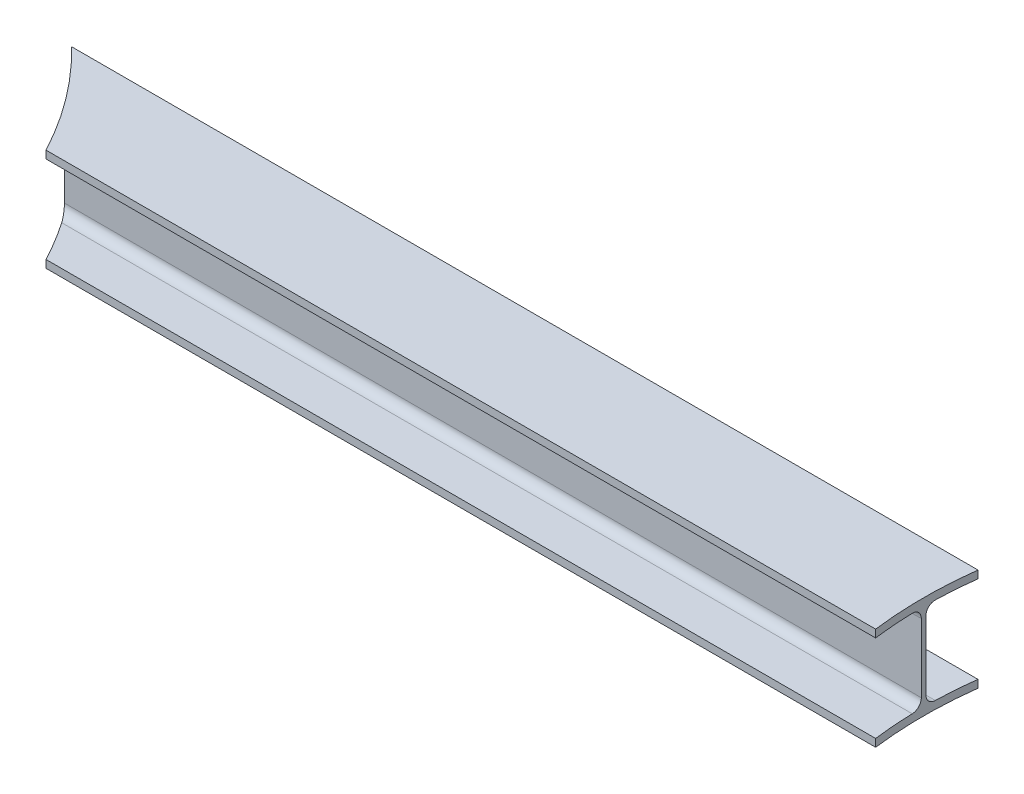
ISO-10303-21;
HEADER;
FILE_DESCRIPTION(('STEP AP214'),'2;1');
FILE_NAME('part.step','',(''),(''),'','','');
FILE_SCHEMA(('AUTOMOTIVE_DESIGN { 1 0 10303 214 1 1 1 1 }'));
ENDSEC;
DATA;
#1=APPLICATION_CONTEXT('core data for automotive mechanical design processes');
#2=APPLICATION_PROTOCOL_DEFINITION('international standard','automotive_design',2000,#1);
#3=PRODUCT_CONTEXT('',#1,'mechanical');
#4=PRODUCT('Part','Part','',(#3));
#5=PRODUCT_RELATED_PRODUCT_CATEGORY('part','',(#4));
#6=PRODUCT_DEFINITION_FORMATION('','',#4);
#7=PRODUCT_DEFINITION_CONTEXT('part definition',#1,'design');
#8=PRODUCT_DEFINITION('design','',#6,#7);
#9=PRODUCT_DEFINITION_SHAPE('','',#8);
#10=(LENGTH_UNIT() NAMED_UNIT(*) SI_UNIT(.MILLI.,.METRE.));
#11=(NAMED_UNIT(*) PLANE_ANGLE_UNIT() SI_UNIT($,.RADIAN.));
#12=(NAMED_UNIT(*) SI_UNIT($,.STERADIAN.) SOLID_ANGLE_UNIT());
#13=UNCERTAINTY_MEASURE_WITH_UNIT(LENGTH_MEASURE(1.E-05),#10,'distance_accuracy_value','');
#14=(GEOMETRIC_REPRESENTATION_CONTEXT(3) GLOBAL_UNCERTAINTY_ASSIGNED_CONTEXT((#13)) GLOBAL_UNIT_ASSIGNED_CONTEXT((#10,
#11,#12)) REPRESENTATION_CONTEXT('',''));
#15=CARTESIAN_POINT('',(0.,0.,0.));
#16=DIRECTION('',(0.,0.,1.));
#17=DIRECTION('',(1.,0.,0.));
#18=AXIS2_PLACEMENT_3D('',#15,#16,#17);
#19=CARTESIAN_POINT('',(3063.27037856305,-100.,0.));
#20=DIRECTION('',(0.,1.,0.));
#21=DIRECTION('',(0.,0.,1.));
#22=AXIS2_PLACEMENT_3D('',#19,#20,#21);
#23=CYLINDRICAL_SURFACE('',#22,800.);
#24=CARTESIAN_POINT('',(3063.27037856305,85.,0.));
#25=DIRECTION('',(0.,1.,0.));
#26=DIRECTION('',(0.,0.,1.));
#27=AXIS2_PLACEMENT_3D('',#24,#25,#26);
#28=CIRCLE('',#27,800.);
#29=CARTESIAN_POINT('',(2263.58684740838,85.,22.5));
#30=VERTEX_POINT('',#29);
#31=CARTESIAN_POINT('',(2269.54498524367,85.,100.));
#32=VERTEX_POINT('',#31);
#33=EDGE_CURVE('E326',#30,#32,#28,.T.);
#34=ORIENTED_EDGE('',*,*,#33,.F.);
#35=CARTESIAN_POINT('',(2263.28303491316,67.,4.49999999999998));
#36=CARTESIAN_POINT('',(2263.28303508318,67.2531475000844,4.49999969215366));
#37=CARTESIAN_POINT('',(2263.28306493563,67.5062668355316,4.50534094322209));
#38=CARTESIAN_POINT('',(2263.28318539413,68.0120470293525,4.52669104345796));
#39=CARTESIAN_POINT('',(2263.28327599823,68.2647079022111,4.54269954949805));
#40=CARTESIAN_POINT('',(2263.28364096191,69.0212958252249,4.60669233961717));
#41=CARTESIAN_POINT('',(2263.28400847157,69.5239572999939,4.67064391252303));
#42=CARTESIAN_POINT('',(2263.28501900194,70.5217230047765,4.84062900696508));
#43=CARTESIAN_POINT('',(2263.28566181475,71.0168326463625,4.9466307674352));
#44=CARTESIAN_POINT('',(2263.28686648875,71.7513440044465,5.13656907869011));
#45=CARTESIAN_POINT('',(2263.28730814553,71.9948320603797,5.20504122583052));
#46=CARTESIAN_POINT('',(2263.28827915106,72.4787697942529,5.35219953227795));
#47=CARTESIAN_POINT('',(2263.28880852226,72.7192186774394,5.43088830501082));
#48=CARTESIAN_POINT('',(2263.29054019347,73.4354123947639,5.68210996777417));
#49=CARTESIAN_POINT('',(2263.2918859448,73.9059366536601,5.86978070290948));
#50=CARTESIAN_POINT('',(2263.29503340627,74.8294939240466,6.28410711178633));
#51=CARTESIAN_POINT('',(2263.29683511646,75.2825269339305,6.51076278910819));
#52=CARTESIAN_POINT('',(2263.29994250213,75.9464449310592,6.87869412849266));
#53=CARTESIAN_POINT('',(2263.30104588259,76.1651642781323,7.00600834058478));
#54=CARTESIAN_POINT('',(2263.30339876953,76.5969860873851,7.26970625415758));
#55=CARTESIAN_POINT('',(2263.3046482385,76.8100899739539,7.40608762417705));
#56=CARTESIAN_POINT('',(2263.30863380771,77.4405235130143,7.82855472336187));
#57=CARTESIAN_POINT('',(2263.31160727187,77.8490192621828,8.12798795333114));
#58=CARTESIAN_POINT('',(2263.31828014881,78.6392637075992,8.76014392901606));
#59=CARTESIAN_POINT('',(2263.32197953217,79.02101348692,9.09286532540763));
#60=CARTESIAN_POINT('',(2263.33019886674,79.7551445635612,9.78928651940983));
#61=CARTESIAN_POINT('',(2263.3347188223,80.1075257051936,10.1529864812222));
#62=CARTESIAN_POINT('',(2263.3446694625,80.7804604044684,10.9088389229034));
#63=CARTESIAN_POINT('',(2263.35010032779,81.1010076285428,11.300997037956));
#64=CARTESIAN_POINT('',(2263.36195261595,81.7079169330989,12.1109075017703));
#65=CARTESIAN_POINT('',(2263.36837402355,81.9942795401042,12.5286594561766));
#66=CARTESIAN_POINT('',(2263.38227586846,82.5308184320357,13.3868339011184));
#67=CARTESIAN_POINT('',(2263.38975642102,82.780990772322,13.8272588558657));
#68=CARTESIAN_POINT('',(2263.40582783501,83.2433505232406,14.7276335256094));
#69=CARTESIAN_POINT('',(2263.41441876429,83.4555356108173,15.1875844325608));
#70=CARTESIAN_POINT('',(2263.43273699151,83.8402989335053,16.1234637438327));
#71=CARTESIAN_POINT('',(2263.44246372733,84.0128966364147,16.5993841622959));
#72=CARTESIAN_POINT('',(2263.4630647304,84.3173705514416,17.5639763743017));
#73=CARTESIAN_POINT('',(2263.47393872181,84.4492565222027,18.0526450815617));
#74=CARTESIAN_POINT('',(2263.49289844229,84.6333725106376,18.8702872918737));
#75=CARTESIAN_POINT('',(2263.50066429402,84.6974153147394,19.1966599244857));
#76=CARTESIAN_POINT('',(2263.51667373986,84.8073269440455,19.852434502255));
#77=CARTESIAN_POINT('',(2263.52491729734,84.8531971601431,20.1818362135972));
#78=CARTESIAN_POINT('',(2263.54185398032,84.9265656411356,20.8421640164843));
#79=CARTESIAN_POINT('',(2263.55054641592,84.9540912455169,21.17308709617));
#80=CARTESIAN_POINT('',(2263.56837211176,84.9908151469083,21.8360074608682));
#81=CARTESIAN_POINT('',(2263.57750546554,85.0000095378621,22.1680049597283));
#82=CARTESIAN_POINT('',(2263.58684740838,85.,22.5));
#83=B_SPLINE_CURVE_WITH_KNOTS('',3,(#35,#36,#37,#38,#39,#40,#41,#42,#43,#44,#45,#46,#47,#48,#49,
#50,#51,#52,#53,#54,#55,#56,#57,#58,#59,#60,#61,#62,#63,#64,#65,#66,#67,#68,#69,#70,#71,#72,#73,
#74,#75,#76,#77,#78,#79,#80,#81,#82),.UNSPECIFIED.,.F.,.F.,(4,2,2,2,2,2,2,2,2,2,2,2,2,2,2,2,2,2,
2,2,2,2,2,4),(0.,0.75932993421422,1.51863544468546,3.03686036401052,4.55394072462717,
5.31254293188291,6.07133957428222,7.58914178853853,9.1069441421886,9.86597922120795,
10.6248198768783,12.1423500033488,13.6598186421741,15.1772953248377,16.6950733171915,
18.212827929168,19.7307478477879,21.2487605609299,22.7660251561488,24.2829257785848,
25.2805256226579,26.2780490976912,27.2740825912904,28.2703282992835),.UNSPECIFIED.);
#84=CARTESIAN_POINT('',(2263.28303491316,67.,4.49999999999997));
#85=VERTEX_POINT('',#84);
#86=EDGE_CURVE('E320',#85,#30,#83,.T.);
#87=ORIENTED_EDGE('',*,*,#86,.F.);
#88=DIRECTION('',(0.,1.,0.));
#89=VECTOR('',#88,1.);
#90=CARTESIAN_POINT('',(2263.28303491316,-100.,4.49999999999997));
#91=LINE('',#90,#89);
#92=CARTESIAN_POINT('',(2263.28303491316,-67.,4.49999999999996));
#93=VERTEX_POINT('',#92);
#94=EDGE_CURVE('E298',#93,#85,#91,.T.);
#95=ORIENTED_EDGE('',*,*,#94,.F.);
#96=CARTESIAN_POINT('',(2263.58684740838,-85.,22.5));
#97=CARTESIAN_POINT('',(2263.57972624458,-85.0000003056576,22.2469095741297));
#98=CARTESIAN_POINT('',(2263.57272641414,-84.9946614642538,21.9938438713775));
#99=CARTESIAN_POINT('',(2263.55897890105,-84.9733201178,21.4881637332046));
#100=CARTESIAN_POINT('',(2263.55223121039,-84.9573179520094,21.2355492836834));
#101=CARTESIAN_POINT('',(2263.53238323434,-84.8933486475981,20.4790884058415));
#102=CARTESIAN_POINT('',(2263.5196744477,-84.8294186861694,19.9764965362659));
#103=CARTESIAN_POINT('',(2263.49537733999,-84.6594809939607,18.9788364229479));
#104=CARTESIAN_POINT('',(2263.48378819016,-84.5535046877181,18.4837628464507));
#105=CARTESIAN_POINT('',(2263.46726343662,-84.3636029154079,17.7492853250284));
#106=CARTESIAN_POINT('',(2263.46189814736,-84.295142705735,17.5058052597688));
#107=CARTESIAN_POINT('',(2263.45145262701,-84.1480070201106,17.0218770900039));
#108=CARTESIAN_POINT('',(2263.44637246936,-84.0693289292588,16.781429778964));
#109=CARTESIAN_POINT('',(2263.43155954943,-83.8181344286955,16.0652261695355));
#110=CARTESIAN_POINT('',(2263.42225598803,-83.6304767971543,15.5946816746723));
#111=CARTESIAN_POINT('',(2263.40478157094,-83.2161635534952,14.6710651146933));
#112=CARTESIAN_POINT('',(2263.39661071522,-82.9895079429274,14.217993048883));
#113=CARTESIAN_POINT('',(2263.38517555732,-82.6215650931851,13.554007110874));
#114=CARTESIAN_POINT('',(2263.38150041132,-82.4942454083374,13.3352640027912));
#115=CARTESIAN_POINT('',(2263.37441713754,-82.2305322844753,12.9033918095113));
#116=CARTESIAN_POINT('',(2263.3710089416,-82.0941411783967,12.6902613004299));
#117=CARTESIAN_POINT('',(2263.36117174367,-81.6716380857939,12.059744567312));
#118=CARTESIAN_POINT('',(2263.35512937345,-81.3721717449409,11.6511887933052));
#119=CARTESIAN_POINT('',(2263.34400880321,-80.7399961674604,10.8609030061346));
#120=CARTESIAN_POINT('',(2263.33893036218,-80.4072952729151,10.4791663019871));
#121=CARTESIAN_POINT('',(2263.32965026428,-79.7109065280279,9.7450484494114));
#122=CARTESIAN_POINT('',(2263.32544861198,-79.3472185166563,9.39266745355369));
#123=CARTESIAN_POINT('',(2263.31783012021,-78.5913772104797,8.71972137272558));
#124=CARTESIAN_POINT('',(2263.31441343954,-78.1992181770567,8.3991627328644));
#125=CARTESIAN_POINT('',(2263.30827108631,-77.3892911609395,7.79222285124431));
#126=CARTESIAN_POINT('',(2263.30554540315,-76.9715235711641,7.50584108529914));
#127=CARTESIAN_POINT('',(2263.30069064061,-76.113284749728,6.96924955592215));
#128=CARTESIAN_POINT('',(2263.29856164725,-75.6728102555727,6.71904501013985));
#129=CARTESIAN_POINT('',(2263.29481132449,-74.772313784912,6.25662212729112));
#130=CARTESIAN_POINT('',(2263.29319002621,-74.3122906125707,6.04440611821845));
#131=CARTESIAN_POINT('',(2263.29037500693,-73.3762435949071,5.6595876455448));
#132=CARTESIAN_POINT('',(2263.28918107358,-72.9002278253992,5.48696552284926));
#133=CARTESIAN_POINT('',(2263.28715035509,-71.935417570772,5.18245351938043));
#134=CARTESIAN_POINT('',(2263.28631348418,-71.4466261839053,5.05055386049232));
#135=CARTESIAN_POINT('',(2263.28517700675,-70.6289393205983,4.86647016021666));
#136=CARTESIAN_POINT('',(2263.28479156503,-70.3026549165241,4.80245843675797));
#137=CARTESIAN_POINT('',(2263.28413958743,-69.6470475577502,4.69259767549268));
#138=CARTESIAN_POINT('',(2263.28387304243,-69.3177248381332,4.64674724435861));
#139=CARTESIAN_POINT('',(2263.28345032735,-68.6575427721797,4.57340860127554));
#140=CARTESIAN_POINT('',(2263.28329399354,-68.3266864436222,4.54589315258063));
#141=CARTESIAN_POINT('',(2263.28308658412,-67.6638880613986,4.50918212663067));
#142=CARTESIAN_POINT('',(2263.28303553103,-67.3319457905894,4.49999047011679));
#143=CARTESIAN_POINT('',(2263.28303491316,-67.,4.49999999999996));
#144=B_SPLINE_CURVE_WITH_KNOTS('',3,(#96,#97,#98,#99,#100,#101,#102,#103,#104,#105,#106,#107,
#108,#109,#110,#111,#112,#113,#114,#115,#116,#117,#118,#119,#120,#121,#122,#123,#124,#125,#126,
#127,#128,#129,#130,#131,#132,#133,#134,#135,#136,#137,#138,#139,#140,#141,#142,#143),
.UNSPECIFIED.,.F.,.F.,(4,2,2,2,2,2,2,2,2,2,2,2,2,2,2,2,2,2,2,2,2,2,2,4),(0.,0.759459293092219,
1.51889442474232,3.03738204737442,4.55473691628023,5.31347582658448,6.07240929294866,
7.59050323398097,9.10859711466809,9.86777475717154,10.6267579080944,12.1445725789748,
13.6620072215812,15.179449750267,16.6971989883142,18.2149249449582,19.7328695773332,
21.2509071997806,22.7681894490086,24.285107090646,25.2821585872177,26.2791335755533,
27.2746242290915,28.2703278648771),.UNSPECIFIED.);
#145=CARTESIAN_POINT('',(2263.58684740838,-85.,22.5));
#146=VERTEX_POINT('',#145);
#147=EDGE_CURVE('E292',#146,#93,#144,.T.);
#148=ORIENTED_EDGE('',*,*,#147,.F.);
#149=CARTESIAN_POINT('',(3063.27037856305,-85.,0.));
#150=DIRECTION('',(0.,-1.,0.));
#151=DIRECTION('',(0.,0.,-1.));
#152=AXIS2_PLACEMENT_3D('',#149,#150,#151);
#153=CIRCLE('',#152,800.);
#154=CARTESIAN_POINT('',(2269.54498524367,-85.,100.));
#155=VERTEX_POINT('',#154);
#156=EDGE_CURVE('E289',#155,#146,#153,.T.);
#157=ORIENTED_EDGE('',*,*,#156,.F.);
#158=DIRECTION('',(0.,1.,0.));
#159=VECTOR('',#158,1.);
#160=CARTESIAN_POINT('',(2269.54498524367,-100.,100.));
#161=LINE('',#160,#159);
#162=CARTESIAN_POINT('',(2269.54498524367,-100.,100.));
#163=VERTEX_POINT('',#162);
#164=EDGE_CURVE('E286',#163,#155,#161,.T.);
#165=ORIENTED_EDGE('',*,*,#164,.F.);
#166=CARTESIAN_POINT('',(3063.27037856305,-100.,0.));
#167=DIRECTION('',(0.,1.,0.));
#168=DIRECTION('',(0.,0.,1.));
#169=AXIS2_PLACEMENT_3D('',#166,#167,#168);
#170=CIRCLE('',#169,800.);
#171=CARTESIAN_POINT('',(2269.54498524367,-100.,-100.));
#172=VERTEX_POINT('',#171);
#173=EDGE_CURVE('E223',#172,#163,#170,.T.);
#174=ORIENTED_EDGE('',*,*,#173,.F.);
#175=DIRECTION('',(0.,1.,0.));
#176=VECTOR('',#175,1.);
#177=CARTESIAN_POINT('',(2269.54498524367,-99.9999999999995,-100.));
#178=LINE('',#177,#176);
#179=CARTESIAN_POINT('',(2269.54498524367,-85.,-99.9999999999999));
#180=VERTEX_POINT('',#179);
#181=EDGE_CURVE('E60',#180,#172,#178,.F.);
#182=ORIENTED_EDGE('',*,*,#181,.F.);
#183=CARTESIAN_POINT('',(3063.27037856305,-85.,0.));
#184=DIRECTION('',(0.,-1.,0.));
#185=DIRECTION('',(0.,0.,-1.));
#186=AXIS2_PLACEMENT_3D('',#183,#184,#185);
#187=CIRCLE('',#186,800.);
#188=CARTESIAN_POINT('',(2263.58684740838,-85.,-22.5));
#189=VERTEX_POINT('',#188);
#190=EDGE_CURVE('E46',#189,#180,#187,.T.);
#191=ORIENTED_EDGE('',*,*,#190,.F.);
#192=CARTESIAN_POINT('',(2263.28303491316,-67.,-4.49999999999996));
#193=CARTESIAN_POINT('',(2263.28303508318,-67.2531475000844,-4.49999969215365));
#194=CARTESIAN_POINT('',(2263.28306493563,-67.5062668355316,-4.50534094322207));
#195=CARTESIAN_POINT('',(2263.28318539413,-68.0120470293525,-4.52669104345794));
#196=CARTESIAN_POINT('',(2263.28327599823,-68.2647079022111,-4.54269954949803));
#197=CARTESIAN_POINT('',(2263.28364096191,-69.0212958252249,-4.60669233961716));
#198=CARTESIAN_POINT('',(2263.28400847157,-69.5239572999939,-4.67064391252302));
#199=CARTESIAN_POINT('',(2263.28501900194,-70.5217230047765,-4.84062900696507));
#200=CARTESIAN_POINT('',(2263.28566181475,-71.0168326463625,-4.94663076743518));
#201=CARTESIAN_POINT('',(2263.28686648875,-71.7513440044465,-5.1365690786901));
#202=CARTESIAN_POINT('',(2263.28730814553,-71.9948320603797,-5.2050412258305));
#203=CARTESIAN_POINT('',(2263.28827915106,-72.4787697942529,-5.35219953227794));
#204=CARTESIAN_POINT('',(2263.28880852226,-72.7192186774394,-5.4308883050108));
#205=CARTESIAN_POINT('',(2263.29054019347,-73.4354123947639,-5.68210996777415));
#206=CARTESIAN_POINT('',(2263.2918859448,-73.9059366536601,-5.86978070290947));
#207=CARTESIAN_POINT('',(2263.29503340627,-74.8294939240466,-6.28410711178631));
#208=CARTESIAN_POINT('',(2263.29683511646,-75.2825269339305,-6.51076278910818));
#209=CARTESIAN_POINT('',(2263.29994250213,-75.9464449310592,-6.87869412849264));
#210=CARTESIAN_POINT('',(2263.30104588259,-76.1651642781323,-7.00600834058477));
#211=CARTESIAN_POINT('',(2263.30339876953,-76.5969860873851,-7.26970625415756));
#212=CARTESIAN_POINT('',(2263.3046482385,-76.8100899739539,-7.40608762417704));
#213=CARTESIAN_POINT('',(2263.30863380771,-77.4405235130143,-7.82855472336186));
#214=CARTESIAN_POINT('',(2263.31160727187,-77.8490192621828,-8.12798795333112));
#215=CARTESIAN_POINT('',(2263.31828014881,-78.6392637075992,-8.76014392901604));
#216=CARTESIAN_POINT('',(2263.32197953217,-79.02101348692,-9.09286532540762));
#217=CARTESIAN_POINT('',(2263.33019886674,-79.7551445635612,-9.78928651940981));
#218=CARTESIAN_POINT('',(2263.3347188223,-80.1075257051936,-10.1529864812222));
#219=CARTESIAN_POINT('',(2263.3446694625,-80.7804604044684,-10.9088389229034));
#220=CARTESIAN_POINT('',(2263.35010032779,-81.1010076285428,-11.300997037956));
#221=CARTESIAN_POINT('',(2263.36195261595,-81.7079169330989,-12.1109075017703));
#222=CARTESIAN_POINT('',(2263.36837402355,-81.9942795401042,-12.5286594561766));
#223=CARTESIAN_POINT('',(2263.38227586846,-82.5308184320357,-13.3868339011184));
#224=CARTESIAN_POINT('',(2263.38975642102,-82.780990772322,-13.8272588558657));
#225=CARTESIAN_POINT('',(2263.40582783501,-83.2433505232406,-14.7276335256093));
#226=CARTESIAN_POINT('',(2263.41441876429,-83.4555356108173,-15.1875844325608));
#227=CARTESIAN_POINT('',(2263.43273699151,-83.8402989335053,-16.1234637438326));
#228=CARTESIAN_POINT('',(2263.44246372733,-84.0128966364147,-16.5993841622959));
#229=CARTESIAN_POINT('',(2263.4630647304,-84.3173705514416,-17.5639763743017));
#230=CARTESIAN_POINT('',(2263.47393872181,-84.4492565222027,-18.0526450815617));
#231=CARTESIAN_POINT('',(2263.49289844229,-84.6333725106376,-18.8702872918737));
#232=CARTESIAN_POINT('',(2263.50066429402,-84.6974153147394,-19.1966599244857));
#233=CARTESIAN_POINT('',(2263.51667373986,-84.8073269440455,-19.852434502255));
#234=CARTESIAN_POINT('',(2263.52491729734,-84.8531971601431,-20.1818362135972));
#235=CARTESIAN_POINT('',(2263.54185398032,-84.9265656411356,-20.8421640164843));
#236=CARTESIAN_POINT('',(2263.55054641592,-84.9540912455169,-21.17308709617));
#237=CARTESIAN_POINT('',(2263.56837211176,-84.9908151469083,-21.8360074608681));
#238=CARTESIAN_POINT('',(2263.57750546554,-85.0000095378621,-22.1680049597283));
#239=CARTESIAN_POINT('',(2263.58684740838,-85.,-22.5));
#240=B_SPLINE_CURVE_WITH_KNOTS('',3,(#192,#193,#194,#195,#196,#197,#198,#199,#200,#201,#202,
#203,#204,#205,#206,#207,#208,#209,#210,#211,#212,#213,#214,#215,#216,#217,#218,#219,#220,#221,
#222,#223,#224,#225,#226,#227,#228,#229,#230,#231,#232,#233,#234,#235,#236,#237,#238,#239),
.UNSPECIFIED.,.F.,.F.,(4,2,2,2,2,2,2,2,2,2,2,2,2,2,2,2,2,2,2,2,2,2,2,4),(0.,0.75932993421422,
1.51863544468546,3.03686036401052,4.55394072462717,5.31254293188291,6.07133957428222,
7.58914178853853,9.1069441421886,9.86597922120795,10.6248198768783,12.1423500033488,
13.6598186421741,15.1772953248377,16.6950733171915,18.212827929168,19.7307478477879,
21.2487605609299,22.7660251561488,24.2829257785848,25.2805256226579,26.2780490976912,
27.2740825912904,28.2703282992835),.UNSPECIFIED.);
#241=CARTESIAN_POINT('',(2263.28303491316,-67.,-4.49999999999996));
#242=VERTEX_POINT('',#241);
#243=EDGE_CURVE('E220',#242,#189,#240,.T.);
#244=ORIENTED_EDGE('',*,*,#243,.F.);
#245=DIRECTION('',(0.,1.,0.));
#246=VECTOR('',#245,1.);
#247=CARTESIAN_POINT('',(2263.28303491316,-100.,-4.49999999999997));
#248=LINE('',#247,#246);
#249=CARTESIAN_POINT('',(2263.28303491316,67.,-4.49999999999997));
#250=VERTEX_POINT('',#249);
#251=EDGE_CURVE('E217',#250,#242,#248,.F.);
#252=ORIENTED_EDGE('',*,*,#251,.F.);
#253=CARTESIAN_POINT('',(2263.58684740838,85.,-22.5));
#254=CARTESIAN_POINT('',(2263.57972624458,85.0000003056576,-22.2469095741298));
#255=CARTESIAN_POINT('',(2263.57272641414,84.9946614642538,-21.9938438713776));
#256=CARTESIAN_POINT('',(2263.55897890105,84.9733201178,-21.4881637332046));
#257=CARTESIAN_POINT('',(2263.55223121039,84.9573179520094,-21.2355492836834));
#258=CARTESIAN_POINT('',(2263.53238323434,84.8933486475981,-20.4790884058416));
#259=CARTESIAN_POINT('',(2263.5196744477,84.8294186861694,-19.976496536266));
#260=CARTESIAN_POINT('',(2263.49537733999,84.6594809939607,-18.9788364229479));
#261=CARTESIAN_POINT('',(2263.48378819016,84.5535046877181,-18.4837628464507));
#262=CARTESIAN_POINT('',(2263.46726343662,84.3636029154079,-17.7492853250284));
#263=CARTESIAN_POINT('',(2263.46189814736,84.295142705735,-17.5058052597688));
#264=CARTESIAN_POINT('',(2263.45145262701,84.1480070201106,-17.0218770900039));
#265=CARTESIAN_POINT('',(2263.44637246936,84.0693289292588,-16.781429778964));
#266=CARTESIAN_POINT('',(2263.43155954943,83.8181344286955,-16.0652261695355));
#267=CARTESIAN_POINT('',(2263.42225598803,83.6304767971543,-15.5946816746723));
#268=CARTESIAN_POINT('',(2263.40478157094,83.2161635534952,-14.6710651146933));
#269=CARTESIAN_POINT('',(2263.39661071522,82.9895079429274,-14.217993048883));
#270=CARTESIAN_POINT('',(2263.38517555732,82.6215650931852,-13.554007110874));
#271=CARTESIAN_POINT('',(2263.38150041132,82.4942454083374,-13.3352640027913));
#272=CARTESIAN_POINT('',(2263.37441713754,82.2305322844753,-12.9033918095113));
#273=CARTESIAN_POINT('',(2263.3710089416,82.0941411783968,-12.69026130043));
#274=CARTESIAN_POINT('',(2263.36117174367,81.6716380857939,-12.059744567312));
#275=CARTESIAN_POINT('',(2263.35512937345,81.3721717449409,-11.6511887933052));
#276=CARTESIAN_POINT('',(2263.34400880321,80.7399961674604,-10.8609030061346));
#277=CARTESIAN_POINT('',(2263.33893036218,80.4072952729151,-10.4791663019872));
#278=CARTESIAN_POINT('',(2263.32965026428,79.7109065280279,-9.74504844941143));
#279=CARTESIAN_POINT('',(2263.32544861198,79.3472185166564,-9.39266745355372));
#280=CARTESIAN_POINT('',(2263.31783012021,78.5913772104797,-8.71972137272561));
#281=CARTESIAN_POINT('',(2263.31441343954,78.1992181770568,-8.39916273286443));
#282=CARTESIAN_POINT('',(2263.30827108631,77.3892911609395,-7.79222285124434));
#283=CARTESIAN_POINT('',(2263.30554540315,76.9715235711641,-7.50584108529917));
#284=CARTESIAN_POINT('',(2263.30069064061,76.113284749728,-6.96924955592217));
#285=CARTESIAN_POINT('',(2263.29856164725,75.6728102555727,-6.71904501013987));
#286=CARTESIAN_POINT('',(2263.29481132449,74.772313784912,-6.25662212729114));
#287=CARTESIAN_POINT('',(2263.29319002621,74.3122906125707,-6.04440611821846));
#288=CARTESIAN_POINT('',(2263.29037500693,73.3762435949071,-5.65958764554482));
#289=CARTESIAN_POINT('',(2263.28918107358,72.9002278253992,-5.48696552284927));
#290=CARTESIAN_POINT('',(2263.28715035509,71.935417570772,-5.18245351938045));
#291=CARTESIAN_POINT('',(2263.28631348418,71.4466261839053,-5.05055386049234));
#292=CARTESIAN_POINT('',(2263.28517700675,70.6289393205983,-4.86647016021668));
#293=CARTESIAN_POINT('',(2263.28479156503,70.3026549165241,-4.80245843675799));
#294=CARTESIAN_POINT('',(2263.28413958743,69.6470475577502,-4.6925976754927));
#295=CARTESIAN_POINT('',(2263.28387304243,69.3177248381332,-4.64674724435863));
#296=CARTESIAN_POINT('',(2263.28345032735,68.6575427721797,-4.57340860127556));
#297=CARTESIAN_POINT('',(2263.28329399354,68.3266864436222,-4.54589315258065));
#298=CARTESIAN_POINT('',(2263.28308658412,67.6638880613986,-4.50918212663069));
#299=CARTESIAN_POINT('',(2263.28303553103,67.3319457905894,-4.49999047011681));
#300=CARTESIAN_POINT('',(2263.28303491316,67.,-4.49999999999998));
#301=B_SPLINE_CURVE_WITH_KNOTS('',3,(#253,#254,#255,#256,#257,#258,#259,#260,#261,#262,#263,
#264,#265,#266,#267,#268,#269,#270,#271,#272,#273,#274,#275,#276,#277,#278,#279,#280,#281,#282,
#283,#284,#285,#286,#287,#288,#289,#290,#291,#292,#293,#294,#295,#296,#297,#298,#299,#300),
.UNSPECIFIED.,.F.,.F.,(4,2,2,2,2,2,2,2,2,2,2,2,2,2,2,2,2,2,2,2,2,2,2,4),(0.,0.759459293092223,
1.51889442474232,3.03738204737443,4.55473691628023,5.31347582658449,6.07240929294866,
7.59050323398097,9.10859711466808,9.86777475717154,10.6267579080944,12.1445725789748,
13.6620072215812,15.179449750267,16.6971989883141,18.2149249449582,19.7328695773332,
21.2509071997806,22.7681894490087,24.285107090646,25.2821585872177,26.2791335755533,
27.2746242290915,28.2703278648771),.UNSPECIFIED.);
#302=CARTESIAN_POINT('',(2263.58684740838,85.,-22.5));
#303=VERTEX_POINT('',#302);
#304=EDGE_CURVE('E272',#303,#250,#301,.T.);
#305=ORIENTED_EDGE('',*,*,#304,.F.);
#306=CARTESIAN_POINT('',(3063.27037856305,85.,0.));
#307=DIRECTION('',(0.,1.,0.));
#308=DIRECTION('',(0.,0.,1.));
#309=AXIS2_PLACEMENT_3D('',#306,#307,#308);
#310=CIRCLE('',#309,800.);
#311=CARTESIAN_POINT('',(2269.54498524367,85.,-100.));
#312=VERTEX_POINT('',#311);
#313=EDGE_CURVE('E279',#312,#303,#310,.T.);
#314=ORIENTED_EDGE('',*,*,#313,.F.);
#315=DIRECTION('',(0.,1.,0.));
#316=VECTOR('',#315,1.);
#317=CARTESIAN_POINT('',(2269.54498524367,-100.,-100.));
#318=LINE('',#317,#316);
#319=CARTESIAN_POINT('',(2269.54498524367,100.,-100.));
#320=VERTEX_POINT('',#319);
#321=EDGE_CURVE('E283',#320,#312,#318,.F.);
#322=ORIENTED_EDGE('',*,*,#321,.F.);
#323=CARTESIAN_POINT('',(3063.27037856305,100.,0.));
#324=DIRECTION('',(0.,1.,0.));
#325=DIRECTION('',(0.,0.,1.));
#326=AXIS2_PLACEMENT_3D('',#323,#324,#325);
#327=CIRCLE('',#326,800.);
#328=CARTESIAN_POINT('',(2269.54498524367,100.,100.));
#329=VERTEX_POINT('',#328);
#330=EDGE_CURVE('E221',#320,#329,#327,.T.);
#331=ORIENTED_EDGE('',*,*,#330,.T.);
#332=DIRECTION('',(0.,1.,0.));
#333=VECTOR('',#332,1.);
#334=CARTESIAN_POINT('',(2269.54498524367,-100.,100.));
#335=LINE('',#334,#333);
#336=EDGE_CURVE('E169',#32,#329,#335,.T.);
#337=ORIENTED_EDGE('',*,*,#336,.F.);
#338=EDGE_LOOP('',(#34,#87,#95,#148,#157,#165,#174,#182,#191,#244,#252,#305,#314,#322,#331,#337));
#339=FACE_BOUND('',#338,.T.);
#340=ADVANCED_FACE('F37',(#339),#23,.F.);
#341=CARTESIAN_POINT('',(2363.27037856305,-85.,-99.9999999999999));
#342=DIRECTION('',(0.,-1.,0.));
#343=DIRECTION('',(0.,0.,-1.));
#344=AXIS2_PLACEMENT_3D('',#341,#342,#343);
#345=PLANE('',#344);
#346=CARTESIAN_POINT('',(-58.4029469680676,-84.9999999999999,474.207088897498));
#347=DIRECTION('',(0.,-1.,0.));
#348=DIRECTION('',(0.,0.,-1.));
#349=AXIS2_PLACEMENT_3D('',#346,#347,#348);
#350=CIRCLE('',#349,800.);
#351=CARTESIAN_POINT('',(568.719104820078,-85.,-22.5));
#352=VERTEX_POINT('',#351);
#353=CARTESIAN_POINT('',(498.630462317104,-85.0000000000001,-99.9999999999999));
#354=VERTEX_POINT('',#353);
#355=EDGE_CURVE('E11',#352,#354,#350,.F.);
#356=ORIENTED_EDGE('',*,*,#355,.F.);
#357=DIRECTION('',(-1.,0.,0.));
#358=VECTOR('',#357,1.);
#359=CARTESIAN_POINT('',(2363.27037856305,-85.,-22.5));
#360=LINE('',#359,#358);
#361=EDGE_CURVE('E165',#189,#352,#360,.T.);
#362=ORIENTED_EDGE('',*,*,#361,.F.);
#363=ORIENTED_EDGE('',*,*,#190,.T.);
#364=DIRECTION('',(-1.,0.,0.));
#365=VECTOR('',#364,1.);
#366=CARTESIAN_POINT('',(2363.27037856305,-85.,-99.9999999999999));
#367=LINE('',#366,#365);
#368=EDGE_CURVE('E159',#180,#354,#367,.T.);
#369=ORIENTED_EDGE('',*,*,#368,.T.);
#370=EDGE_LOOP('',(#356,#362,#363,#369));
#371=FACE_BOUND('',#370,.T.);
#372=ADVANCED_FACE('F164',(#371),#345,.F.);
#373=CARTESIAN_POINT('',(2363.27037856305,-100.,-100.));
#374=DIRECTION('',(0.,0.,1.));
#375=DIRECTION('',(0.,-1.,0.));
#376=AXIS2_PLACEMENT_3D('',#373,#374,#375);
#377=PLANE('',#376);
#378=DIRECTION('',(0.,-1.,0.));
#379=VECTOR('',#378,1.);
#380=CARTESIAN_POINT('',(498.630462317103,-337.72683831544,-100.000000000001));
#381=LINE('',#380,#379);
#382=CARTESIAN_POINT('',(498.630462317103,-99.9999999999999,-100.000000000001));
#383=VERTEX_POINT('',#382);
#384=EDGE_CURVE('E149',#354,#383,#381,.T.);
#385=ORIENTED_EDGE('',*,*,#384,.F.);
#386=ORIENTED_EDGE('',*,*,#368,.F.);
#387=ORIENTED_EDGE('',*,*,#181,.T.);
#388=DIRECTION('',(-1.,0.,0.));
#389=VECTOR('',#388,1.);
#390=CARTESIAN_POINT('',(2363.27037856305,-100.,-100.));
#391=LINE('',#390,#389);
#392=EDGE_CURVE('E161',#172,#383,#391,.T.);
#393=ORIENTED_EDGE('',*,*,#392,.T.);
#394=EDGE_LOOP('',(#385,#386,#387,#393));
#395=FACE_BOUND('',#394,.T.);
#396=ADVANCED_FACE('F158',(#395),#377,.F.);
#397=CARTESIAN_POINT('',(2363.27037856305,-100.,100.));
#398=DIRECTION('',(0.,1.,0.));
#399=DIRECTION('',(0.,0.,1.));
#400=AXIS2_PLACEMENT_3D('',#397,#398,#399);
#401=PLANE('',#400);
#402=CARTESIAN_POINT('',(-58.4029469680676,-100.,474.207088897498));
#403=DIRECTION('',(0.,1.,0.));
#404=DIRECTION('',(0.,0.,1.));
#405=AXIS2_PLACEMENT_3D('',#402,#403,#404);
#406=CIRCLE('',#405,800.);
#407=CARTESIAN_POINT('',(648.681952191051,-100.,100.));
#408=VERTEX_POINT('',#407);
#409=EDGE_CURVE('E162',#383,#408,#406,.F.);
#410=ORIENTED_EDGE('',*,*,#409,.F.);
#411=ORIENTED_EDGE('',*,*,#392,.F.);
#412=ORIENTED_EDGE('',*,*,#173,.T.);
#413=DIRECTION('',(-1.,0.,0.));
#414=VECTOR('',#413,1.);
#415=CARTESIAN_POINT('',(2363.27037856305,-100.,100.));
#416=LINE('',#415,#414);
#417=EDGE_CURVE('E167',#163,#408,#416,.T.);
#418=ORIENTED_EDGE('',*,*,#417,.T.);
#419=EDGE_LOOP('',(#410,#411,#412,#418));
#420=FACE_BOUND('',#419,.T.);
#421=ADVANCED_FACE('F363',(#420),#401,.F.);
#422=CARTESIAN_POINT('',(2363.27037856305,-85.,100.));
#423=DIRECTION('',(0.,0.,-1.));
#424=DIRECTION('',(-1.,0.,0.));
#425=AXIS2_PLACEMENT_3D('',#422,#423,#424);
#426=PLANE('',#425);
#427=DIRECTION('',(0.,-1.,0.));
#428=VECTOR('',#427,1.);
#429=CARTESIAN_POINT('',(648.681952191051,-337.726838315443,100.));
#430=LINE('',#429,#428);
#431=CARTESIAN_POINT('',(648.681952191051,-85.,100.));
#432=VERTEX_POINT('',#431);
#433=EDGE_CURVE('E352',#408,#432,#430,.F.);
#434=ORIENTED_EDGE('',*,*,#433,.F.);
#435=ORIENTED_EDGE('',*,*,#417,.F.);
#436=ORIENTED_EDGE('',*,*,#164,.T.);
#437=DIRECTION('',(-1.,0.,0.));
#438=VECTOR('',#437,1.);
#439=CARTESIAN_POINT('',(2363.27037856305,-85.,100.));
#440=LINE('',#439,#438);
#441=EDGE_CURVE('E175',#155,#432,#440,.T.);
#442=ORIENTED_EDGE('',*,*,#441,.T.);
#443=EDGE_LOOP('',(#434,#435,#436,#442));
#444=FACE_BOUND('',#443,.T.);
#445=ADVANCED_FACE('F360',(#444),#426,.F.);
#446=CARTESIAN_POINT('',(2363.27037856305,-85.,22.5));
#447=DIRECTION('',(0.,-1.,0.));
#448=DIRECTION('',(0.,0.,-1.));
#449=AXIS2_PLACEMENT_3D('',#446,#447,#448);
#450=PLANE('',#449);
#451=CARTESIAN_POINT('',(-58.4029469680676,-85.0000000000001,474.207088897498));
#452=DIRECTION('',(0.,-1.,0.));
#453=DIRECTION('',(0.,0.,-1.));
#454=AXIS2_PLACEMENT_3D('',#451,#452,#453);
#455=CIRCLE('',#454,800.);
#456=CARTESIAN_POINT('',(601.870258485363,-85.,22.5));
#457=VERTEX_POINT('',#456);
#458=EDGE_CURVE('E350',#432,#457,#455,.F.);
#459=ORIENTED_EDGE('',*,*,#458,.F.);
#460=ORIENTED_EDGE('',*,*,#441,.F.);
#461=ORIENTED_EDGE('',*,*,#156,.T.);
#462=DIRECTION('',(-1.,0.,0.));
#463=VECTOR('',#462,1.);
#464=CARTESIAN_POINT('',(2363.27037856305,-85.,22.5));
#465=LINE('',#464,#463);
#466=EDGE_CURVE('E178',#146,#457,#465,.T.);
#467=ORIENTED_EDGE('',*,*,#466,.T.);
#468=EDGE_LOOP('',(#459,#460,#461,#467));
#469=FACE_BOUND('',#468,.T.);
#470=ADVANCED_FACE('F306',(#469),#450,.F.);
#471=CARTESIAN_POINT('',(2363.27037856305,-67.,22.5));
#472=DIRECTION('',(-1.,0.,0.));
#473=DIRECTION('',(0.,0.,1.));
#474=AXIS2_PLACEMENT_3D('',#471,#472,#473);
#475=CYLINDRICAL_SURFACE('',#474,18.);
#476=CARTESIAN_POINT('',(601.870258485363,-85.,22.5));
#477=CARTESIAN_POINT('',(601.440103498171,-84.9999618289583,21.871209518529));
#478=CARTESIAN_POINT('',(601.009018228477,-84.9670496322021,21.243027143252));
#479=CARTESIAN_POINT('',(600.148097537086,-84.8355631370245,19.9922790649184));
#480=CARTESIAN_POINT('',(599.718262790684,-84.7369582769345,19.3697161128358));
#481=CARTESIAN_POINT('',(598.859430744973,-84.4729647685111,18.1295271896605));
#482=CARTESIAN_POINT('',(598.430477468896,-84.3069705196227,17.5119992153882));
#483=CARTESIAN_POINT('',(597.581173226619,-83.9080873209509,16.2929207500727));
#484=CARTESIAN_POINT('',(597.160820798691,-83.6752098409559,15.6913675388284));
#485=CARTESIAN_POINT('',(596.350826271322,-83.1539732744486,14.5354967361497));
#486=CARTESIAN_POINT('',(595.960645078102,-82.868486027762,13.9802639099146));
#487=CARTESIAN_POINT('',(595.195718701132,-82.2358375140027,12.8945862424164));
#488=CARTESIAN_POINT('',(594.820975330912,-81.8886690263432,12.3641443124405));
#489=CARTESIAN_POINT('',(594.093065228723,-81.134248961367,11.336319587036));
#490=CARTESIAN_POINT('',(593.739815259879,-80.7272532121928,10.8388085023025));
#491=CARTESIAN_POINT('',(593.058477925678,-79.8526476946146,9.88138778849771));
#492=CARTESIAN_POINT('',(592.730377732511,-79.3850691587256,9.42145898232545));
#493=CARTESIAN_POINT('',(592.206324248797,-78.5515686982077,8.68833646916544));
#494=CARTESIAN_POINT('',(592.001944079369,-78.2016594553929,8.40284748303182));
#495=CARTESIAN_POINT('',(591.609381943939,-77.4755193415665,7.85519852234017));
#496=CARTESIAN_POINT('',(591.421196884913,-77.0992935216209,7.59303409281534));
#497=CARTESIAN_POINT('',(591.063058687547,-76.3214524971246,7.09468087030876));
#498=CARTESIAN_POINT('',(590.893111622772,-75.919828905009,6.85850072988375));
#499=CARTESIAN_POINT('',(590.653651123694,-75.2998826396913,6.52605320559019));
#500=CARTESIAN_POINT('',(590.576405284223,-75.0903080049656,6.41887121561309));
#501=CARTESIAN_POINT('',(590.427300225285,-74.6654783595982,6.21208190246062));
#502=CARTESIAN_POINT('',(590.355442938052,-74.4502213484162,6.11247729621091));
#503=CARTESIAN_POINT('',(590.147256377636,-73.7928059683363,5.8240294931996));
#504=CARTESIAN_POINT('',(590.019634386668,-73.3424083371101,5.64738688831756));
#505=CARTESIAN_POINT('',(589.789782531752,-72.4230304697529,5.32946731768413));
#506=CARTESIAN_POINT('',(589.687548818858,-71.9540530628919,5.18818499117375));
#507=CARTESIAN_POINT('',(589.554786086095,-71.240109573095,5.00480652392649));
#508=CARTESIAN_POINT('',(589.513990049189,-71.0005977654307,4.94847496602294));
#509=CARTESIAN_POINT('',(589.439401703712,-70.5184604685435,4.84550618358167));
#510=CARTESIAN_POINT('',(589.405607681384,-70.2758357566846,4.79886658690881));
#511=CARTESIAN_POINT('',(589.345213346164,-69.7881548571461,4.71553044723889));
#512=CARTESIAN_POINT('',(589.318608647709,-69.5431002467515,4.67882784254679));
#513=CARTESIAN_POINT('',(589.272708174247,-69.0510234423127,4.61551395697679));
#514=CARTESIAN_POINT('',(589.253411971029,-68.8040013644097,4.58890208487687));
#515=CARTESIAN_POINT('',(589.221552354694,-68.2977357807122,4.54496705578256));
#516=CARTESIAN_POINT('',(589.209321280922,-68.0384313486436,4.52810238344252));
#517=CARTESIAN_POINT('',(589.193015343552,-67.5194178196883,4.50562027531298));
#518=CARTESIAN_POINT('',(589.18892991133,-67.2597096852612,4.49998826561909));
#519=CARTESIAN_POINT('',(589.188938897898,-67.,4.49999999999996));
#520=B_SPLINE_CURVE_WITH_KNOTS('',3,(#476,#477,#478,#479,#480,#481,#482,#483,#484,#485,#486,
#487,#488,#489,#490,#491,#492,#493,#494,#495,#496,#497,#498,#499,#500,#501,#502,#503,#504,#505,
#506,#507,#508,#509,#510,#511,#512,#513,#514,#515,#516,#517,#518,#519),.UNSPECIFIED.,.F.,.F.,(4,
2,2,2,2,2,2,2,2,2,2,2,2,2,2,2,2,2,2,2,2,4),(0.,2.28487440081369,4.57081251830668,
6.87776492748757,9.18432195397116,11.3900042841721,13.5959449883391,15.7927133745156,
17.9883537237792,19.4740822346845,20.9595263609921,22.4454636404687,23.1884826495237,
23.9317668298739,25.430553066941,26.9291119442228,27.6770747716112,28.4248543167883,
29.1721766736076,29.9194552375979,30.6995022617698,31.4785365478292),.UNSPECIFIED.);
#521=CARTESIAN_POINT('',(589.188938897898,-67.,4.49999999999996));
#522=VERTEX_POINT('',#521);
#523=EDGE_CURVE('E241',#457,#522,#520,.T.);
#524=ORIENTED_EDGE('',*,*,#523,.F.);
#525=ORIENTED_EDGE('',*,*,#466,.F.);
#526=ORIENTED_EDGE('',*,*,#147,.T.);
#527=DIRECTION('',(-1.,0.,0.));
#528=VECTOR('',#527,1.);
#529=CARTESIAN_POINT('',(2363.27037856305,-67.,4.49999999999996));
#530=LINE('',#529,#528);
#531=EDGE_CURVE('E181',#93,#522,#530,.T.);
#532=ORIENTED_EDGE('',*,*,#531,.T.);
#533=EDGE_LOOP('',(#524,#525,#526,#532));
#534=FACE_BOUND('',#533,.T.);
#535=ADVANCED_FACE('F300',(#534),#475,.F.);
#536=CARTESIAN_POINT('',(2363.27037856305,67.,4.49999999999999));
#537=DIRECTION('',(0.,0.,-1.));
#538=DIRECTION('',(0.,1.,0.));
#539=AXIS2_PLACEMENT_3D('',#536,#537,#538);
#540=PLANE('',#539);
#541=DIRECTION('',(0.,-1.,0.));
#542=VECTOR('',#541,1.);
#543=CARTESIAN_POINT('',(589.188938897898,-337.726838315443,4.49999999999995));
#544=LINE('',#543,#542);
#545=CARTESIAN_POINT('',(589.188938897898,67.0000000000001,4.49999999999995));
#546=VERTEX_POINT('',#545);
#547=EDGE_CURVE('E347',#522,#546,#544,.F.);
#548=ORIENTED_EDGE('',*,*,#547,.F.);
#549=ORIENTED_EDGE('',*,*,#531,.F.);
#550=ORIENTED_EDGE('',*,*,#94,.T.);
#551=DIRECTION('',(-1.,0.,0.));
#552=VECTOR('',#551,1.);
#553=CARTESIAN_POINT('',(2363.27037856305,67.,4.49999999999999));
#554=LINE('',#553,#552);
#555=EDGE_CURVE('E184',#85,#546,#554,.T.);
#556=ORIENTED_EDGE('',*,*,#555,.T.);
#557=EDGE_LOOP('',(#548,#549,#550,#556));
#558=FACE_BOUND('',#557,.T.);
#559=ADVANCED_FACE('F305',(#558),#540,.F.);
#560=CARTESIAN_POINT('',(2363.27037856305,67.,22.5));
#561=DIRECTION('',(-1.,0.,0.));
#562=DIRECTION('',(0.,0.,1.));
#563=AXIS2_PLACEMENT_3D('',#560,#561,#562);
#564=CYLINDRICAL_SURFACE('',#563,18.);
#565=CARTESIAN_POINT('',(589.188938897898,67.,4.49999999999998));
#566=CARTESIAN_POINT('',(589.188937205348,67.2194570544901,4.49999791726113));
#567=CARTESIAN_POINT('',(589.191850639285,67.4388833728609,4.50401442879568));
#568=CARTESIAN_POINT('',(589.203483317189,67.8772787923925,4.52005310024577));
#569=CARTESIAN_POINT('',(589.212202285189,68.0962479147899,4.53207487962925));
#570=CARTESIAN_POINT('',(589.24701462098,68.7515942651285,4.58007846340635));
#571=CARTESIAN_POINT('',(589.281763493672,69.1867258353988,4.62799860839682));
#572=CARTESIAN_POINT('',(589.373491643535,70.0474654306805,4.75454434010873));
#573=CARTESIAN_POINT('',(589.430342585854,70.4731137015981,4.83299266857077));
#574=CARTESIAN_POINT('',(589.565367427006,71.3144723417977,5.0194113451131));
#575=CARTESIAN_POINT('',(589.643542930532,71.7301819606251,5.1273839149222));
#576=CARTESIAN_POINT('',(589.819875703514,72.5481756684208,5.3710890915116));
#577=CARTESIAN_POINT('',(589.91799797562,72.9504818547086,5.506773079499));
#578=CARTESIAN_POINT('',(590.132954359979,73.740180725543,5.80425122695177));
#579=CARTESIAN_POINT('',(590.249790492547,74.1275717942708,5.96604820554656));
#580=CARTESIAN_POINT('',(590.500830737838,74.8859356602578,6.31400995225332));
#581=CARTESIAN_POINT('',(590.635053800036,75.2568899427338,6.50020130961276));
#582=CARTESIAN_POINT('',(590.919247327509,75.9804523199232,6.89483022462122));
#583=CARTESIAN_POINT('',(591.069218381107,76.3330597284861,7.10326861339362));
#584=CARTESIAN_POINT('',(591.394452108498,77.0429267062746,7.55580246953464));
#585=CARTESIAN_POINT('',(591.570751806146,77.3987686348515,7.80137480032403));
#586=CARTESIAN_POINT('',(591.937921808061,78.0872374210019,8.31348120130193));
#587=CARTESIAN_POINT('',(592.128796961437,78.4198564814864,8.5800222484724));
#588=CARTESIAN_POINT('',(592.523371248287,79.0610771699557,9.13177966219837));
#589=CARTESIAN_POINT('',(592.727070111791,79.3696793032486,9.41699563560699));
#590=CARTESIAN_POINT('',(593.145700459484,79.9624250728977,10.0040190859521));
#591=CARTESIAN_POINT('',(593.360631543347,80.2465695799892,10.3058259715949));
#592=CARTESIAN_POINT('',(593.840362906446,80.8397302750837,10.9805074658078));
#593=CARTESIAN_POINT('',(594.107113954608,81.1438443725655,11.3563110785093));
#594=CARTESIAN_POINT('',(594.65221170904,81.7175043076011,12.1257300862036));
#595=CARTESIAN_POINT('',(594.930563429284,81.987034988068,12.5193531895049));
#596=CARTESIAN_POINT('',(595.497015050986,82.4915737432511,13.3219827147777));
#597=CARTESIAN_POINT('',(595.78512241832,82.7265546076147,13.7310009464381));
#598=CARTESIAN_POINT('',(596.36910649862,83.1618228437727,14.5617735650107));
#599=CARTESIAN_POINT('',(596.664984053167,83.362106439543,14.9835293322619));
#600=CARTESIAN_POINT('',(597.31738997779,83.7614289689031,15.9154575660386));
#601=CARTESIAN_POINT('',(597.675142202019,83.9535852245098,16.427732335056));
#602=CARTESIAN_POINT('',(598.396808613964,84.2896737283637,17.4637476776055));
#603=CARTESIAN_POINT('',(598.760724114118,84.4335955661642,17.9874907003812));
#604=CARTESIAN_POINT('',(599.491767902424,84.6730460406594,19.0423326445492));
#605=CARTESIAN_POINT('',(599.858889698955,84.7686562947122,19.5734175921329));
#606=CARTESIAN_POINT('',(600.594843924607,84.9118255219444,20.6408518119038));
#607=CARTESIAN_POINT('',(600.963676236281,84.9593877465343,21.1772007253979));
#608=CARTESIAN_POINT('',(601.511705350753,84.9942827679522,21.9762264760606));
#609=CARTESIAN_POINT('',(601.691070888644,84.9999993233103,22.2380748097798));
#610=CARTESIAN_POINT('',(601.870258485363,85.,22.5));
#611=B_SPLINE_CURVE_WITH_KNOTS('',3,(#565,#566,#567,#568,#569,#570,#571,#572,#573,#574,#575,
#576,#577,#578,#579,#580,#581,#582,#583,#584,#585,#586,#587,#588,#589,#590,#591,#592,#593,#594,
#595,#596,#597,#598,#599,#600,#601,#602,#603,#604,#605,#606,#607,#608,#609,#610),.UNSPECIFIED.,
.F.,.F.,(4,2,2,2,2,2,2,2,2,2,2,2,2,2,2,2,2,2,2,2,2,2,4),(0.,0.658254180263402,1.31647707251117,
2.63198025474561,3.93995643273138,5.24803106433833,6.55383013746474,7.8597702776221,
9.1671458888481,10.4745703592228,11.8739669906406,13.2738312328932,14.6736660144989,
16.0734509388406,17.7282946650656,19.3838612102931,21.040724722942,22.6977684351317,
24.6568843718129,26.616422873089,28.5726397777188,30.5287242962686,31.4808294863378),.UNSPECIFIED.);
#612=CARTESIAN_POINT('',(601.870258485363,85.,22.5));
#613=VERTEX_POINT('',#612);
#614=EDGE_CURVE('E250',#546,#613,#611,.T.);
#615=ORIENTED_EDGE('',*,*,#614,.F.);
#616=ORIENTED_EDGE('',*,*,#555,.F.);
#617=ORIENTED_EDGE('',*,*,#86,.T.);
#618=DIRECTION('',(-1.,0.,0.));
#619=VECTOR('',#618,1.);
#620=CARTESIAN_POINT('',(2363.27037856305,85.,22.5));
#621=LINE('',#620,#619);
#622=EDGE_CURVE('E187',#30,#613,#621,.T.);
#623=ORIENTED_EDGE('',*,*,#622,.T.);
#624=EDGE_LOOP('',(#615,#616,#617,#623));
#625=FACE_BOUND('',#624,.T.);
#626=ADVANCED_FACE('F311',(#625),#564,.F.);
#627=CARTESIAN_POINT('',(2363.27037856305,85.,100.));
#628=DIRECTION('',(0.,1.,0.));
#629=DIRECTION('',(0.,0.,1.));
#630=AXIS2_PLACEMENT_3D('',#627,#628,#629);
#631=PLANE('',#630);
#632=CARTESIAN_POINT('',(-58.4029469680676,85.,474.207088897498));
#633=DIRECTION('',(0.,1.,0.));
#634=DIRECTION('',(0.,0.,1.));
#635=AXIS2_PLACEMENT_3D('',#632,#633,#634);
#636=CIRCLE('',#635,800.);
#637=CARTESIAN_POINT('',(648.681952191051,85.,100.));
#638=VERTEX_POINT('',#637);
#639=EDGE_CURVE('E344',#613,#638,#636,.F.);
#640=ORIENTED_EDGE('',*,*,#639,.F.);
#641=ORIENTED_EDGE('',*,*,#622,.F.);
#642=ORIENTED_EDGE('',*,*,#33,.T.);
#643=DIRECTION('',(-1.,0.,0.));
#644=VECTOR('',#643,1.);
#645=CARTESIAN_POINT('',(2363.27037856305,85.,100.));
#646=LINE('',#645,#644);
#647=EDGE_CURVE('E190',#32,#638,#646,.T.);
#648=ORIENTED_EDGE('',*,*,#647,.T.);
#649=EDGE_LOOP('',(#640,#641,#642,#648));
#650=FACE_BOUND('',#649,.T.);
#651=ADVANCED_FACE('F316',(#650),#631,.F.);
#652=CARTESIAN_POINT('',(2363.27037856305,100.,100.));
#653=DIRECTION('',(0.,0.,-1.));
#654=DIRECTION('',(-1.,0.,0.));
#655=AXIS2_PLACEMENT_3D('',#652,#653,#654);
#656=PLANE('',#655);
#657=DIRECTION('',(0.,-1.,0.));
#658=VECTOR('',#657,1.);
#659=CARTESIAN_POINT('',(648.681952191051,-337.726838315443,100.));
#660=LINE('',#659,#658);
#661=CARTESIAN_POINT('',(648.681952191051,100.,100.));
#662=VERTEX_POINT('',#661);
#663=EDGE_CURVE('E342',#638,#662,#660,.F.);
#664=ORIENTED_EDGE('',*,*,#663,.F.);
#665=ORIENTED_EDGE('',*,*,#647,.F.);
#666=ORIENTED_EDGE('',*,*,#336,.T.);
#667=DIRECTION('',(-1.,0.,0.));
#668=VECTOR('',#667,1.);
#669=CARTESIAN_POINT('',(2363.27037856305,100.,100.));
#670=LINE('',#669,#668);
#671=EDGE_CURVE('E193',#329,#662,#670,.T.);
#672=ORIENTED_EDGE('',*,*,#671,.T.);
#673=EDGE_LOOP('',(#664,#665,#666,#672));
#674=FACE_BOUND('',#673,.T.);
#675=ADVANCED_FACE('F333',(#674),#656,.F.);
#676=CARTESIAN_POINT('',(2363.27037856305,100.,-100.));
#677=DIRECTION('',(0.,-1.,0.));
#678=DIRECTION('',(0.,0.,-1.));
#679=AXIS2_PLACEMENT_3D('',#676,#677,#678);
#680=PLANE('',#679);
#681=CARTESIAN_POINT('',(-58.4029469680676,100.,474.207088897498));
#682=DIRECTION('',(0.,-1.,0.));
#683=DIRECTION('',(0.,0.,-1.));
#684=AXIS2_PLACEMENT_3D('',#681,#682,#683);
#685=CIRCLE('',#684,800.);
#686=CARTESIAN_POINT('',(498.630462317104,100.,-100.));
#687=VERTEX_POINT('',#686);
#688=EDGE_CURVE('E339',#662,#687,#685,.F.);
#689=ORIENTED_EDGE('',*,*,#688,.F.);
#690=ORIENTED_EDGE('',*,*,#671,.F.);
#691=ORIENTED_EDGE('',*,*,#330,.F.);
#692=DIRECTION('',(-1.,0.,0.));
#693=VECTOR('',#692,1.);
#694=CARTESIAN_POINT('',(2363.27037856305,100.,-100.));
#695=LINE('',#694,#693);
#696=EDGE_CURVE('E196',#320,#687,#695,.T.);
#697=ORIENTED_EDGE('',*,*,#696,.T.);
#698=EDGE_LOOP('',(#689,#690,#691,#697));
#699=FACE_BOUND('',#698,.T.);
#700=ADVANCED_FACE('F337',(#699),#680,.F.);
#701=CARTESIAN_POINT('',(2363.27037856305,85.,-100.));
#702=DIRECTION('',(0.,0.,1.));
#703=DIRECTION('',(1.,0.,0.));
#704=AXIS2_PLACEMENT_3D('',#701,#702,#703);
#705=PLANE('',#704);
#706=DIRECTION('',(0.,-1.,0.));
#707=VECTOR('',#706,1.);
#708=CARTESIAN_POINT('',(498.630462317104,-337.726838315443,-100.));
#709=LINE('',#708,#707);
#710=CARTESIAN_POINT('',(498.630462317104,85.,-100.));
#711=VERTEX_POINT('',#710);
#712=EDGE_CURVE('E341',#687,#711,#709,.T.);
#713=ORIENTED_EDGE('',*,*,#712,.F.);
#714=ORIENTED_EDGE('',*,*,#696,.F.);
#715=ORIENTED_EDGE('',*,*,#321,.T.);
#716=DIRECTION('',(-1.,0.,0.));
#717=VECTOR('',#716,1.);
#718=CARTESIAN_POINT('',(2363.27037856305,85.,-100.));
#719=LINE('',#718,#717);
#720=EDGE_CURVE('E199',#312,#711,#719,.T.);
#721=ORIENTED_EDGE('',*,*,#720,.T.);
#722=EDGE_LOOP('',(#713,#714,#715,#721));
#723=FACE_BOUND('',#722,.T.);
#724=ADVANCED_FACE('F426',(#723),#705,.F.);
#725=CARTESIAN_POINT('',(2363.27037856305,85.,-22.5));
#726=DIRECTION('',(0.,1.,0.));
#727=DIRECTION('',(0.,0.,1.));
#728=AXIS2_PLACEMENT_3D('',#725,#726,#727);
#729=PLANE('',#728);
#730=CARTESIAN_POINT('',(-58.4029469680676,85.0000000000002,474.207088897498));
#731=DIRECTION('',(0.,1.,0.));
#732=DIRECTION('',(0.,0.,1.));
#733=AXIS2_PLACEMENT_3D('',#730,#731,#732);
#734=CIRCLE('',#733,800.);
#735=CARTESIAN_POINT('',(568.719104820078,85.,-22.5));
#736=VERTEX_POINT('',#735);
#737=EDGE_CURVE('E261',#711,#736,#734,.F.);
#738=ORIENTED_EDGE('',*,*,#737,.F.);
#739=ORIENTED_EDGE('',*,*,#720,.F.);
#740=ORIENTED_EDGE('',*,*,#313,.T.);
#741=DIRECTION('',(-1.,0.,0.));
#742=VECTOR('',#741,1.);
#743=CARTESIAN_POINT('',(2363.27037856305,85.,-22.5));
#744=LINE('',#743,#742);
#745=EDGE_CURVE('E202',#303,#736,#744,.T.);
#746=ORIENTED_EDGE('',*,*,#745,.T.);
#747=EDGE_LOOP('',(#738,#739,#740,#746));
#748=FACE_BOUND('',#747,.T.);
#749=ADVANCED_FACE('F267',(#748),#729,.F.);
#750=CARTESIAN_POINT('',(2363.27037856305,67.,-22.5));
#751=DIRECTION('',(-1.,0.,0.));
#752=DIRECTION('',(0.,0.,1.));
#753=AXIS2_PLACEMENT_3D('',#750,#751,#752);
#754=CYLINDRICAL_SURFACE('',#753,18.);
#755=CARTESIAN_POINT('',(568.719104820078,85.,-22.5));
#756=CARTESIAN_POINT('',(568.955139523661,84.9999939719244,-22.2019927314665));
#757=CARTESIAN_POINT('',(569.190937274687,84.9925989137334,-21.9038470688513));
#758=CARTESIAN_POINT('',(569.661758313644,84.962947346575,-21.30766386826));
#759=CARTESIAN_POINT('',(569.896781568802,84.9406902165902,-21.0096263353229));
#760=CARTESIAN_POINT('',(570.600466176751,84.8514689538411,-20.1159643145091));
#761=CARTESIAN_POINT('',(571.067482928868,84.7620547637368,-19.5211179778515));
#762=CARTESIAN_POINT('',(571.996823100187,84.5217992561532,-18.3339774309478));
#763=CARTESIAN_POINT('',(572.459097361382,84.3705685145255,-17.7417239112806));
#764=CARTESIAN_POINT('',(573.372504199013,84.0056024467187,-16.5681465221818));
#765=CARTESIAN_POINT('',(573.823640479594,83.7918882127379,-15.9868190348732));
#766=CARTESIAN_POINT('',(574.641261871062,83.3394053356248,-14.9303183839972));
#767=CARTESIAN_POINT('',(575.009894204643,83.1098751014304,-14.4528388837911));
#768=CARTESIAN_POINT('',(575.734224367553,82.6047967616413,-13.5125026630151));
#769=CARTESIAN_POINT('',(576.089922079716,82.3292482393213,-13.0496460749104));
#770=CARTESIAN_POINT('',(576.784718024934,81.7322052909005,-12.1435618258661));
#771=CARTESIAN_POINT('',(577.123853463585,81.4108208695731,-11.7002904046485));
#772=CARTESIAN_POINT('',(577.783212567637,80.7212365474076,-10.8366878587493));
#773=CARTESIAN_POINT('',(578.103440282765,80.3530467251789,-10.416351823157));
#774=CARTESIAN_POINT('',(578.661274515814,79.6461034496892,-9.68271981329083));
#775=CARTESIAN_POINT('',(578.902835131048,79.3155572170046,-9.36450789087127));
#776=CARTESIAN_POINT('',(579.369299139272,78.6244434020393,-8.74913180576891));
#777=CARTESIAN_POINT('',(579.594203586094,78.2638777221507,-8.45196631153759));
#778=CARTESIAN_POINT('',(580.025046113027,77.5135115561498,-7.8819332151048));
#779=CARTESIAN_POINT('',(580.230991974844,77.1237231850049,-7.60905564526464));
#780=CARTESIAN_POINT('',(580.523866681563,76.5181605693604,-7.22053095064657));
#781=CARTESIAN_POINT('',(580.618815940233,76.3128303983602,-7.09449016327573));
#782=CARTESIAN_POINT('',(580.803110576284,75.8953276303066,-6.84970552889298));
#783=CARTESIAN_POINT('',(580.89245447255,75.6831532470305,-6.73096361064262));
#784=CARTESIAN_POINT('',(581.125901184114,75.1008359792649,-6.42053438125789));
#785=CARTESIAN_POINT('',(581.264374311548,74.7244416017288,-6.23621084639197));
#786=CARTESIAN_POINT('',(581.522509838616,73.9543677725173,-5.89233413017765));
#787=CARTESIAN_POINT('',(581.642175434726,73.5606912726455,-5.73277673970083));
#788=CARTESIAN_POINT('',(581.861118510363,72.7585371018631,-5.44065659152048));
#789=CARTESIAN_POINT('',(581.960422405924,72.3500794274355,-5.30805885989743));
#790=CARTESIAN_POINT('',(582.137474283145,71.5204246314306,-5.07152592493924));
#791=CARTESIAN_POINT('',(582.215227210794,71.0992304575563,-4.96758414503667));
#792=CARTESIAN_POINT('',(582.328294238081,70.3738833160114,-4.81637875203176));
#793=CARTESIAN_POINT('',(582.369352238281,70.0721899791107,-4.76145292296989));
#794=CARTESIAN_POINT('',(582.439977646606,69.4651200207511,-4.66695450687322));
#795=CARTESIAN_POINT('',(582.469547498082,69.1597441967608,-4.62737865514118));
#796=CARTESIAN_POINT('',(582.517002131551,68.5459994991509,-4.56385895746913));
#797=CARTESIAN_POINT('',(582.534869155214,68.2376267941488,-4.53993886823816));
#798=CARTESIAN_POINT('',(582.558727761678,67.6195064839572,-4.50799504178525));
#799=CARTESIAN_POINT('',(582.564715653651,67.3097584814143,-4.49997624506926));
#800=CARTESIAN_POINT('',(582.564698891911,67.,-4.49999999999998));
#801=B_SPLINE_CURVE_WITH_KNOTS('',3,(#755,#756,#757,#758,#759,#760,#761,#762,#763,#764,#765,
#766,#767,#768,#769,#770,#771,#772,#773,#774,#775,#776,#777,#778,#779,#780,#781,#782,#783,#784,
#785,#786,#787,#788,#789,#790,#791,#792,#793,#794,#795,#796,#797,#798,#799,#800),.UNSPECIFIED.,
.F.,.F.,(4,2,2,2,2,2,2,2,2,2,2,2,2,2,2,2,2,2,2,2,2,2,4),(0.,1.14032531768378,2.28069828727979,
4.56269435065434,6.85929340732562,9.15511810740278,11.0895768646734,13.024053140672,
14.9539625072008,16.8834570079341,18.4375990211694,19.9916426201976,21.5450454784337,
22.3217177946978,23.0985944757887,24.4212935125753,25.743767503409,27.0645147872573,
28.3849587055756,29.3125599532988,30.2399638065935,31.1687716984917,32.0978681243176),.UNSPECIFIED.);
#802=CARTESIAN_POINT('',(582.564698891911,67.,-4.49999999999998));
#803=VERTEX_POINT('',#802);
#804=EDGE_CURVE('E225',#736,#803,#801,.T.);
#805=ORIENTED_EDGE('',*,*,#804,.F.);
#806=ORIENTED_EDGE('',*,*,#745,.F.);
#807=ORIENTED_EDGE('',*,*,#304,.T.);
#808=DIRECTION('',(-1.,0.,0.));
#809=VECTOR('',#808,1.);
#810=CARTESIAN_POINT('',(2363.27037856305,67.,-4.49999999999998));
#811=LINE('',#810,#809);
#812=EDGE_CURVE('E205',#250,#803,#811,.T.);
#813=ORIENTED_EDGE('',*,*,#812,.T.);
#814=EDGE_LOOP('',(#805,#806,#807,#813));
#815=FACE_BOUND('',#814,.T.);
#816=ADVANCED_FACE('F263',(#815),#754,.F.);
#817=CARTESIAN_POINT('',(2363.27037856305,67.,-4.49999999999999));
#818=DIRECTION('',(0.,0.,1.));
#819=DIRECTION('',(0.,-1.,0.));
#820=AXIS2_PLACEMENT_3D('',#817,#818,#819);
#821=PLANE('',#820);
#822=DIRECTION('',(0.,-1.,0.));
#823=VECTOR('',#822,1.);
#824=CARTESIAN_POINT('',(582.564698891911,-337.726838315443,-4.49999999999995));
#825=LINE('',#824,#823);
#826=CARTESIAN_POINT('',(582.564698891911,-67.0000000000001,-4.49999999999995));
#827=VERTEX_POINT('',#826);
#828=EDGE_CURVE('E216',#803,#827,#825,.T.);
#829=ORIENTED_EDGE('',*,*,#828,.F.);
#830=ORIENTED_EDGE('',*,*,#812,.F.);
#831=ORIENTED_EDGE('',*,*,#251,.T.);
#832=DIRECTION('',(-1.,0.,0.));
#833=VECTOR('',#832,1.);
#834=CARTESIAN_POINT('',(2363.27037856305,-67.,-4.49999999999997));
#835=LINE('',#834,#833);
#836=EDGE_CURVE('E208',#242,#827,#835,.T.);
#837=ORIENTED_EDGE('',*,*,#836,.T.);
#838=EDGE_LOOP('',(#829,#830,#831,#837));
#839=FACE_BOUND('',#838,.T.);
#840=ADVANCED_FACE('F214',(#839),#821,.F.);
#841=CARTESIAN_POINT('',(2363.27037856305,-67.,-22.5));
#842=DIRECTION('',(-1.,0.,0.));
#843=DIRECTION('',(0.,0.,1.));
#844=AXIS2_PLACEMENT_3D('',#841,#842,#843);
#845=CYLINDRICAL_SURFACE('',#844,18.);
#846=CARTESIAN_POINT('',(582.564698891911,-67.,-4.49999999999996));
#847=CARTESIAN_POINT('',(582.564700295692,-67.2171767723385,-4.49999787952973));
#848=CARTESIAN_POINT('',(582.561762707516,-67.4343231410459,-4.50393145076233));
#849=CARTESIAN_POINT('',(582.550031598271,-67.8681637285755,-4.51963837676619));
#850=CARTESIAN_POINT('',(582.541238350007,-68.0848579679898,-4.53141136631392));
#851=CARTESIAN_POINT('',(582.506124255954,-68.7334015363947,-4.57842055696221));
#852=CARTESIAN_POINT('',(582.471068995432,-69.1640184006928,-4.62534707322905));
#853=CARTESIAN_POINT('',(582.378472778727,-70.0158393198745,-4.74925357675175));
#854=CARTESIAN_POINT('',(582.321060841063,-70.4370829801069,-4.82606112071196));
#855=CARTESIAN_POINT('',(582.184590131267,-71.2697202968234,-5.008541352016));
#856=CARTESIAN_POINT('',(582.105529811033,-71.6811132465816,-5.11421610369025));
#857=CARTESIAN_POINT('',(581.927015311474,-72.4906115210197,-5.35266912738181));
#858=CARTESIAN_POINT('',(581.827595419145,-72.888737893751,-5.48540183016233));
#859=CARTESIAN_POINT('',(581.609545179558,-73.6701825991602,-5.7762888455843));
#860=CARTESIAN_POINT('',(581.4909127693,-74.0534993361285,-5.93444588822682));
#861=CARTESIAN_POINT('',(581.235696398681,-74.8038061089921,-6.27438952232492));
#862=CARTESIAN_POINT('',(581.099093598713,-75.17077846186,-6.45620091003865));
#863=CARTESIAN_POINT('',(580.809472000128,-75.8865022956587,-6.84128857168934));
#864=CARTESIAN_POINT('',(580.656452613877,-76.2352531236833,-7.04456561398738));
#865=CARTESIAN_POINT('',(580.324543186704,-76.9364379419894,-7.48500611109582));
#866=CARTESIAN_POINT('',(580.144602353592,-77.2875170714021,-7.72353283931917));
#867=CARTESIAN_POINT('',(579.769292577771,-77.9667864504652,-8.22040786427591));
#868=CARTESIAN_POINT('',(579.573918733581,-78.294969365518,-8.47876245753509));
#869=CARTESIAN_POINT('',(579.169411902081,-78.9277295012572,-9.01294320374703));
#870=CARTESIAN_POINT('',(578.960279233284,-79.2323072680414,-9.28876895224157));
#871=CARTESIAN_POINT('',(578.529767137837,-79.8175383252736,-9.85576284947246));
#872=CARTESIAN_POINT('',(578.308387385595,-80.0981909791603,-10.1469314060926));
#873=CARTESIAN_POINT('',(577.811986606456,-80.6861338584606,-10.7988452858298));
#874=CARTESIAN_POINT('',(577.534722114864,-80.9884682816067,-11.1623575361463));
#875=CARTESIAN_POINT('',(576.967043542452,-81.5592042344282,-11.9052373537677));
#876=CARTESIAN_POINT('',(576.676630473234,-81.8276083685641,-12.2846037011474));
#877=CARTESIAN_POINT('',(576.084263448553,-82.3310456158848,-13.0569225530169));
#878=CARTESIAN_POINT('',(575.782298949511,-82.5660472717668,-13.4498874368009));
#879=CARTESIAN_POINT('',(575.168824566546,-83.0027739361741,-14.2466583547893));
#880=CARTESIAN_POINT('',(574.85731441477,-83.2044980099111,-14.6504646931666));
#881=CARTESIAN_POINT('',(574.160464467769,-83.6137940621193,-15.5519529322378));
#882=CARTESIAN_POINT('',(573.773277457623,-83.8138100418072,-16.0516479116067));
#883=CARTESIAN_POINT('',(572.989700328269,-84.1667180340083,-17.0603870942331));
#884=CARTESIAN_POINT('',(572.593309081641,-84.3196042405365,-17.5694324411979));
#885=CARTESIAN_POINT('',(571.793959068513,-84.5788733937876,-18.5933587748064));
#886=CARTESIAN_POINT('',(571.391006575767,-84.6852983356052,-19.1082340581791));
#887=CARTESIAN_POINT('',(570.580346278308,-84.852477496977,-20.1414190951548));
#888=CARTESIAN_POINT('',(570.17263962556,-84.9132425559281,-20.6597280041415));
#889=CARTESIAN_POINT('',(569.416200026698,-84.9838397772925,-21.6189238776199));
#890=CARTESIAN_POINT('',(569.067869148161,-84.9999828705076,-22.0596700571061));
#891=CARTESIAN_POINT('',(568.719104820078,-85.,-22.5));
#892=B_SPLINE_CURVE_WITH_KNOTS('',3,(#846,#847,#848,#849,#850,#851,#852,#853,#854,#855,#856,
#857,#858,#859,#860,#861,#862,#863,#864,#865,#866,#867,#868,#869,#870,#871,#872,#873,#874,#875,
#876,#877,#878,#879,#880,#881,#882,#883,#884,#885,#886,#887,#888,#889,#890,#891),.UNSPECIFIED.,
.F.,.F.,(4,2,2,2,2,2,2,2,2,2,2,2,2,2,2,2,2,2,2,2,2,2,4),(0.,0.651414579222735,1.30279881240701,
2.60465060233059,3.89909827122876,5.19363853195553,6.48601636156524,7.77853305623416,
9.07241574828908,10.3663447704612,11.7480445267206,13.130184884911,14.5122932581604,
15.8944383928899,17.5372010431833,19.1798375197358,20.8240108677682,22.4682303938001,
24.455393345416,26.4428010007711,28.428408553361,30.4135445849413,32.0985857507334),.UNSPECIFIED.);
#893=EDGE_CURVE('E52',#827,#352,#892,.T.);
#894=ORIENTED_EDGE('',*,*,#893,.F.);
#895=ORIENTED_EDGE('',*,*,#836,.F.);
#896=ORIENTED_EDGE('',*,*,#243,.T.);
#897=ORIENTED_EDGE('',*,*,#361,.T.);
#898=EDGE_LOOP('',(#894,#895,#896,#897));
#899=FACE_BOUND('',#898,.T.);
#900=ADVANCED_FACE('F39',(#899),#845,.F.);
#901=CARTESIAN_POINT('',(-58.4029469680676,-337.726838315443,474.207088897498));
#902=DIRECTION('',(0.,-1.,0.));
#903=DIRECTION('',(0.,0.,-1.));
#904=AXIS2_PLACEMENT_3D('',#901,#902,#903);
#905=CYLINDRICAL_SURFACE('',#904,800.);
#906=ORIENTED_EDGE('',*,*,#893,.T.);
#907=ORIENTED_EDGE('',*,*,#355,.T.);
#908=ORIENTED_EDGE('',*,*,#384,.T.);
#909=ORIENTED_EDGE('',*,*,#409,.T.);
#910=ORIENTED_EDGE('',*,*,#433,.T.);
#911=ORIENTED_EDGE('',*,*,#458,.T.);
#912=ORIENTED_EDGE('',*,*,#523,.T.);
#913=ORIENTED_EDGE('',*,*,#547,.T.);
#914=ORIENTED_EDGE('',*,*,#614,.T.);
#915=ORIENTED_EDGE('',*,*,#639,.T.);
#916=ORIENTED_EDGE('',*,*,#663,.T.);
#917=ORIENTED_EDGE('',*,*,#688,.T.);
#918=ORIENTED_EDGE('',*,*,#712,.T.);
#919=ORIENTED_EDGE('',*,*,#737,.T.);
#920=ORIENTED_EDGE('',*,*,#804,.T.);
#921=ORIENTED_EDGE('',*,*,#828,.T.);
#922=EDGE_LOOP('',(#906,#907,#908,#909,#910,#911,#912,#913,#914,#915,#916,#917,#918,#919,#920,#921));
#923=FACE_BOUND('',#922,.T.);
#924=ADVANCED_FACE('F148',(#923),#905,.F.);
#925=CLOSED_SHELL('',(#340,#372,#396,#421,#445,#470,#535,#559,#626,#651,#675,#700,#724,#749,
#816,#840,#900,#924));
#926=MANIFOLD_SOLID_BREP('B2',#925);
#927=ADVANCED_BREP_SHAPE_REPRESENTATION('',(#18,#926),#14);
#928=SHAPE_DEFINITION_REPRESENTATION(#9,#927);
ENDSEC;
END-ISO-10303-21;
